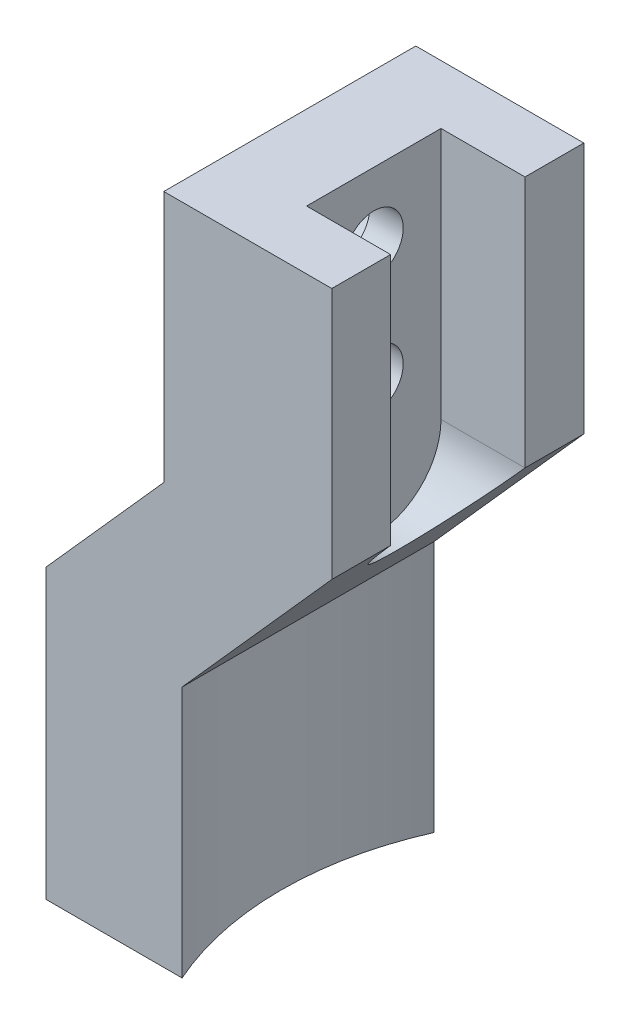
ISO-10303-21;
HEADER;
FILE_DESCRIPTION(('STEP AP214'),'2;1');
FILE_NAME('part.step','',(''),(''),'','','');
FILE_SCHEMA(('AUTOMOTIVE_DESIGN { 1 0 10303 214 1 1 1 1 }'));
ENDSEC;
DATA;
#1=APPLICATION_CONTEXT('core data for automotive mechanical design processes');
#2=APPLICATION_PROTOCOL_DEFINITION('international standard','automotive_design',2000,#1);
#3=PRODUCT_CONTEXT('',#1,'mechanical');
#4=PRODUCT('Part','Part','',(#3));
#5=PRODUCT_RELATED_PRODUCT_CATEGORY('part','',(#4));
#6=PRODUCT_DEFINITION_FORMATION('','',#4);
#7=PRODUCT_DEFINITION_CONTEXT('part definition',#1,'design');
#8=PRODUCT_DEFINITION('design','',#6,#7);
#9=PRODUCT_DEFINITION_SHAPE('','',#8);
#10=(LENGTH_UNIT() NAMED_UNIT(*) SI_UNIT(.MILLI.,.METRE.));
#11=(NAMED_UNIT(*) PLANE_ANGLE_UNIT() SI_UNIT($,.RADIAN.));
#12=(NAMED_UNIT(*) SI_UNIT($,.STERADIAN.) SOLID_ANGLE_UNIT());
#13=UNCERTAINTY_MEASURE_WITH_UNIT(LENGTH_MEASURE(1.E-05),#10,'distance_accuracy_value','');
#14=(GEOMETRIC_REPRESENTATION_CONTEXT(3) GLOBAL_UNCERTAINTY_ASSIGNED_CONTEXT((#13)) GLOBAL_UNIT_ASSIGNED_CONTEXT((#10,
#11,#12)) REPRESENTATION_CONTEXT('',''));
#15=CARTESIAN_POINT('',(0.,0.,0.));
#16=DIRECTION('',(0.,0.,1.));
#17=DIRECTION('',(1.,0.,0.));
#18=AXIS2_PLACEMENT_3D('',#15,#16,#17);
#19=CARTESIAN_POINT('',(-25.,9.00000000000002,7.5));
#20=DIRECTION('',(1.,0.,0.));
#21=DIRECTION('',(0.,1.,0.));
#22=AXIS2_PLACEMENT_3D('',#19,#20,#21);
#23=CYLINDRICAL_SURFACE('',#22,1.75);
#24=CARTESIAN_POINT('',(-13.,9.00000000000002,7.5));
#25=DIRECTION('',(1.,0.,0.));
#26=DIRECTION('',(0.,1.,0.));
#27=AXIS2_PLACEMENT_3D('',#24,#25,#26);
#28=CIRCLE('',#27,1.75);
#29=CARTESIAN_POINT('',(-13.,10.75,7.5));
#30=VERTEX_POINT('',#29);
#31=EDGE_CURVE('E123',#30,#30,#28,.F.);
#32=ORIENTED_EDGE('',*,*,#31,.F.);
#33=EDGE_LOOP('',(#32));
#34=FACE_BOUND('',#33,.T.);
#35=CARTESIAN_POINT('',(-15.,9.00000000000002,7.5));
#36=DIRECTION('',(1.,0.,0.));
#37=DIRECTION('',(0.,1.,0.));
#38=AXIS2_PLACEMENT_3D('',#35,#36,#37);
#39=CIRCLE('',#38,1.75);
#40=CARTESIAN_POINT('',(-15.,10.75,7.5));
#41=VERTEX_POINT('',#40);
#42=EDGE_CURVE('E20',#41,#41,#39,.T.);
#43=ORIENTED_EDGE('',*,*,#42,.F.);
#44=EDGE_LOOP('',(#43));
#45=FACE_BOUND('',#44,.T.);
#46=ADVANCED_FACE('F17',(#34,#45),#23,.F.);
#47=CARTESIAN_POINT('',(-25.,16.,7.5));
#48=DIRECTION('',(1.,0.,0.));
#49=DIRECTION('',(0.,1.,0.));
#50=AXIS2_PLACEMENT_3D('',#47,#48,#49);
#51=CYLINDRICAL_SURFACE('',#50,1.75);
#52=CARTESIAN_POINT('',(-13.,16.,7.5));
#53=DIRECTION('',(1.,0.,0.));
#54=DIRECTION('',(0.,1.,0.));
#55=AXIS2_PLACEMENT_3D('',#52,#53,#54);
#56=CIRCLE('',#55,1.75);
#57=CARTESIAN_POINT('',(-13.,17.75,7.5));
#58=VERTEX_POINT('',#57);
#59=EDGE_CURVE('E114',#58,#58,#56,.F.);
#60=ORIENTED_EDGE('',*,*,#59,.F.);
#61=EDGE_LOOP('',(#60));
#62=FACE_BOUND('',#61,.T.);
#63=CARTESIAN_POINT('',(-15.,16.,7.5));
#64=DIRECTION('',(1.,0.,0.));
#65=DIRECTION('',(0.,1.,0.));
#66=AXIS2_PLACEMENT_3D('',#63,#64,#65);
#67=CIRCLE('',#66,1.75);
#68=CARTESIAN_POINT('',(-15.,17.75,7.5));
#69=VERTEX_POINT('',#68);
#70=EDGE_CURVE('E124',#69,#69,#67,.T.);
#71=ORIENTED_EDGE('',*,*,#70,.F.);
#72=EDGE_LOOP('',(#71));
#73=FACE_BOUND('',#72,.T.);
#74=ADVANCED_FACE('F241',(#62,#73),#51,.F.);
#75=CARTESIAN_POINT('',(-15.,9.00000000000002,7.5));
#76=DIRECTION('',(-1.,0.,0.));
#77=DIRECTION('',(0.,0.,1.));
#78=AXIS2_PLACEMENT_3D('',#75,#76,#77);
#79=PLANE('',#78);
#80=ORIENTED_EDGE('',*,*,#42,.T.);
#81=EDGE_LOOP('',(#80));
#82=FACE_BOUND('',#81,.T.);
#83=CARTESIAN_POINT('',(-15.,9.00000000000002,7.5));
#84=DIRECTION('',(-1.,0.,0.));
#85=DIRECTION('',(0.,0.,1.));
#86=AXIS2_PLACEMENT_3D('',#83,#84,#85);
#87=CIRCLE('',#86,3.);
#88=CARTESIAN_POINT('',(-15.,9.00000000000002,10.5));
#89=VERTEX_POINT('',#88);
#90=EDGE_CURVE('E163',#89,#89,#87,.T.);
#91=ORIENTED_EDGE('',*,*,#90,.T.);
#92=EDGE_LOOP('',(#91));
#93=FACE_BOUND('',#92,.T.);
#94=ADVANCED_FACE('F237',(#82,#93),#79,.T.);
#95=CARTESIAN_POINT('',(-15.,16.,7.5));
#96=DIRECTION('',(-1.,0.,0.));
#97=DIRECTION('',(0.,0.,1.));
#98=AXIS2_PLACEMENT_3D('',#95,#96,#97);
#99=PLANE('',#98);
#100=ORIENTED_EDGE('',*,*,#70,.T.);
#101=EDGE_LOOP('',(#100));
#102=FACE_BOUND('',#101,.T.);
#103=CARTESIAN_POINT('',(-15.,16.,7.5));
#104=DIRECTION('',(-1.,0.,0.));
#105=DIRECTION('',(0.,0.,1.));
#106=AXIS2_PLACEMENT_3D('',#103,#104,#105);
#107=CIRCLE('',#106,3.);
#108=CARTESIAN_POINT('',(-15.,16.,10.5));
#109=VERTEX_POINT('',#108);
#110=EDGE_CURVE('E175',#109,#109,#107,.T.);
#111=ORIENTED_EDGE('',*,*,#110,.T.);
#112=EDGE_LOOP('',(#111));
#113=FACE_BOUND('',#112,.T.);
#114=ADVANCED_FACE('F318',(#102,#113),#99,.T.);
#115=CARTESIAN_POINT('',(-13.,5.00000000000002,7.5));
#116=DIRECTION('',(1.,0.,0.));
#117=DIRECTION('',(0.,1.,0.));
#118=AXIS2_PLACEMENT_3D('',#115,#116,#117);
#119=CYLINDRICAL_SURFACE('',#118,4.);
#120=CARTESIAN_POINT('',(-8.,5.00000000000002,7.5));
#121=DIRECTION('',(-0.746569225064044,0.665307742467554,0.));
#122=DIRECTION('',(0.665307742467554,0.746569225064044,0.));
#123=AXIS2_PLACEMENT_3D('',#120,#121,#122);
#124=ELLIPSE('',#123,5.35784206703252,4.);
#125=CARTESIAN_POINT('',(-8.,5.00000000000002,11.5));
#126=VERTEX_POINT('',#125);
#127=CARTESIAN_POINT('',(-8.,5.00000000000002,3.5));
#128=VERTEX_POINT('',#127);
#129=EDGE_CURVE('E120',#126,#128,#124,.F.);
#130=ORIENTED_EDGE('',*,*,#129,.T.);
#131=DIRECTION('',(1.,0.,0.));
#132=VECTOR('',#131,1.);
#133=CARTESIAN_POINT('',(-13.,5.00000000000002,3.5));
#134=LINE('',#133,#132);
#135=CARTESIAN_POINT('',(-13.,5.00000000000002,3.5));
#136=VERTEX_POINT('',#135);
#137=EDGE_CURVE('E117',#128,#136,#134,.F.);
#138=ORIENTED_EDGE('',*,*,#137,.T.);
#139=CARTESIAN_POINT('',(-13.,5.00000000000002,7.5));
#140=DIRECTION('',(1.,0.,0.));
#141=DIRECTION('',(0.,1.,0.));
#142=AXIS2_PLACEMENT_3D('',#139,#140,#141);
#143=CIRCLE('',#142,4.);
#144=CARTESIAN_POINT('',(-13.,5.00000000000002,11.5));
#145=VERTEX_POINT('',#144);
#146=EDGE_CURVE('E103',#145,#136,#143,.T.);
#147=ORIENTED_EDGE('',*,*,#146,.F.);
#148=DIRECTION('',(1.,0.,0.));
#149=VECTOR('',#148,1.);
#150=CARTESIAN_POINT('',(-13.,5.00000000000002,11.5));
#151=LINE('',#150,#149);
#152=EDGE_CURVE('E131',#145,#126,#151,.T.);
#153=ORIENTED_EDGE('',*,*,#152,.T.);
#154=EDGE_LOOP('',(#130,#138,#147,#153));
#155=FACE_BOUND('',#154,.T.);
#156=ADVANCED_FACE('F118',(#155),#119,.F.);
#157=CARTESIAN_POINT('',(0.,-4.99999999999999,7.5));
#158=DIRECTION('',(0.,-1.,0.));
#159=DIRECTION('',(0.,0.,-1.));
#160=AXIS2_PLACEMENT_3D('',#157,#158,#159);
#161=PLANE('',#160);
#162=DIRECTION('',(0.,0.,1.));
#163=VECTOR('',#162,1.);
#164=CARTESIAN_POINT('',(-16.9115345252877,-4.99999999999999,0.));
#165=LINE('',#164,#163);
#166=CARTESIAN_POINT('',(-16.9115345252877,-4.99999999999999,0.));
#167=VERTEX_POINT('',#166);
#168=CARTESIAN_POINT('',(-16.9115345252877,-4.99999999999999,15.));
#169=VERTEX_POINT('',#168);
#170=EDGE_CURVE('E169',#167,#169,#165,.T.);
#171=ORIENTED_EDGE('',*,*,#170,.T.);
#172=CARTESIAN_POINT('',(0.,-4.99999999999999,7.5));
#173=DIRECTION('',(0.,-1.,0.));
#174=DIRECTION('',(0.,0.,-1.));
#175=AXIS2_PLACEMENT_3D('',#172,#173,#174);
#176=CIRCLE('',#175,18.5);
#177=EDGE_CURVE('E220',#169,#167,#176,.T.);
#178=ORIENTED_EDGE('',*,*,#177,.T.);
#179=EDGE_LOOP('',(#171,#178));
#180=FACE_BOUND('',#179,.T.);
#181=ADVANCED_FACE('F312',(#180),#161,.T.);
#182=CARTESIAN_POINT('',(-13.,20.,3.5));
#183=DIRECTION('',(0.,0.,-1.));
#184=DIRECTION('',(0.,1.,0.));
#185=AXIS2_PLACEMENT_3D('',#182,#183,#184);
#186=PLANE('',#185);
#187=DIRECTION('',(1.,0.,0.));
#188=VECTOR('',#187,1.);
#189=CARTESIAN_POINT('',(-25.,20.,3.5));
#190=LINE('',#189,#188);
#191=CARTESIAN_POINT('',(-8.,20.,3.5));
#192=VERTEX_POINT('',#191);
#193=CARTESIAN_POINT('',(-13.,20.,3.5));
#194=VERTEX_POINT('',#193);
#195=EDGE_CURVE('E129',#192,#194,#190,.F.);
#196=ORIENTED_EDGE('',*,*,#195,.T.);
#197=DIRECTION('',(0.,1.,0.));
#198=VECTOR('',#197,1.);
#199=CARTESIAN_POINT('',(-13.,20.,3.5));
#200=LINE('',#199,#198);
#201=EDGE_CURVE('E111',#136,#194,#200,.T.);
#202=ORIENTED_EDGE('',*,*,#201,.F.);
#203=ORIENTED_EDGE('',*,*,#137,.F.);
#204=DIRECTION('',(0.,-1.,0.));
#205=VECTOR('',#204,1.);
#206=CARTESIAN_POINT('',(-8.,48.8688175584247,3.5));
#207=LINE('',#206,#205);
#208=EDGE_CURVE('E139',#128,#192,#207,.F.);
#209=ORIENTED_EDGE('',*,*,#208,.T.);
#210=EDGE_LOOP('',(#196,#202,#203,#209));
#211=FACE_BOUND('',#210,.T.);
#212=ADVANCED_FACE('F127',(#211),#186,.F.);
#213=CARTESIAN_POINT('',(-13.,20.,7.5));
#214=DIRECTION('',(1.,0.,0.));
#215=DIRECTION('',(0.,1.,0.));
#216=AXIS2_PLACEMENT_3D('',#213,#214,#215);
#217=PLANE('',#216);
#218=ORIENTED_EDGE('',*,*,#146,.T.);
#219=ORIENTED_EDGE('',*,*,#201,.T.);
#220=DIRECTION('',(0.,0.,-1.));
#221=VECTOR('',#220,1.);
#222=CARTESIAN_POINT('',(-13.,20.,15.));
#223=LINE('',#222,#221);
#224=CARTESIAN_POINT('',(-13.,20.,11.5));
#225=VERTEX_POINT('',#224);
#226=EDGE_CURVE('E198',#194,#225,#223,.F.);
#227=ORIENTED_EDGE('',*,*,#226,.T.);
#228=DIRECTION('',(0.,-1.,0.));
#229=VECTOR('',#228,1.);
#230=CARTESIAN_POINT('',(-13.,20.,11.5));
#231=LINE('',#230,#229);
#232=EDGE_CURVE('E113',#225,#145,#231,.T.);
#233=ORIENTED_EDGE('',*,*,#232,.T.);
#234=EDGE_LOOP('',(#218,#219,#227,#233));
#235=FACE_BOUND('',#234,.T.);
#236=ORIENTED_EDGE('',*,*,#59,.T.);
#237=EDGE_LOOP('',(#236));
#238=FACE_BOUND('',#237,.T.);
#239=ORIENTED_EDGE('',*,*,#31,.T.);
#240=EDGE_LOOP('',(#239));
#241=FACE_BOUND('',#240,.T.);
#242=ADVANCED_FACE('F107',(#235,#238,#241),#217,.T.);
#243=CARTESIAN_POINT('',(-13.,20.,11.5));
#244=DIRECTION('',(0.,0.,1.));
#245=DIRECTION('',(0.,-1.,0.));
#246=AXIS2_PLACEMENT_3D('',#243,#244,#245);
#247=PLANE('',#246);
#248=ORIENTED_EDGE('',*,*,#152,.F.);
#249=ORIENTED_EDGE('',*,*,#232,.F.);
#250=DIRECTION('',(1.,0.,0.));
#251=VECTOR('',#250,1.);
#252=CARTESIAN_POINT('',(-25.,20.,11.5));
#253=LINE('',#252,#251);
#254=CARTESIAN_POINT('',(-8.,20.,11.5));
#255=VERTEX_POINT('',#254);
#256=EDGE_CURVE('E192',#225,#255,#253,.T.);
#257=ORIENTED_EDGE('',*,*,#256,.T.);
#258=DIRECTION('',(0.,-1.,0.));
#259=VECTOR('',#258,1.);
#260=CARTESIAN_POINT('',(-8.,48.8688175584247,11.5));
#261=LINE('',#260,#259);
#262=EDGE_CURVE('E160',#255,#126,#261,.T.);
#263=ORIENTED_EDGE('',*,*,#262,.T.);
#264=EDGE_LOOP('',(#248,#249,#257,#263));
#265=FACE_BOUND('',#264,.T.);
#266=ADVANCED_FACE('F303',(#265),#247,.F.);
#267=CARTESIAN_POINT('',(-8.,48.8688175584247,0.));
#268=DIRECTION('',(-1.,0.,0.));
#269=DIRECTION('',(0.,-1.,0.));
#270=AXIS2_PLACEMENT_3D('',#267,#268,#269);
#271=PLANE('',#270);
#272=DIRECTION('',(0.,0.,1.));
#273=VECTOR('',#272,1.);
#274=CARTESIAN_POINT('',(-8.,5.00000000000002,0.));
#275=LINE('',#274,#273);
#276=CARTESIAN_POINT('',(-8.,5.00000000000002,15.));
#277=VERTEX_POINT('',#276);
#278=EDGE_CURVE('E145',#277,#126,#275,.F.);
#279=ORIENTED_EDGE('',*,*,#278,.T.);
#280=ORIENTED_EDGE('',*,*,#262,.F.);
#281=DIRECTION('',(0.,0.,-1.));
#282=VECTOR('',#281,1.);
#283=CARTESIAN_POINT('',(-8.,20.,15.));
#284=LINE('',#283,#282);
#285=CARTESIAN_POINT('',(-8.,20.,15.));
#286=VERTEX_POINT('',#285);
#287=EDGE_CURVE('E187',#255,#286,#284,.F.);
#288=ORIENTED_EDGE('',*,*,#287,.T.);
#289=DIRECTION('',(0.,1.,0.));
#290=VECTOR('',#289,1.);
#291=CARTESIAN_POINT('',(-8.,0.,15.));
#292=LINE('',#291,#290);
#293=EDGE_CURVE('E172',#277,#286,#292,.T.);
#294=ORIENTED_EDGE('',*,*,#293,.F.);
#295=EDGE_LOOP('',(#279,#280,#288,#294));
#296=FACE_BOUND('',#295,.T.);
#297=ADVANCED_FACE('F299',(#296),#271,.F.);
#298=CARTESIAN_POINT('',(-15.,9.00000000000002,7.5));
#299=DIRECTION('',(-1.,0.,0.));
#300=DIRECTION('',(0.,0.,1.));
#301=AXIS2_PLACEMENT_3D('',#298,#299,#300);
#302=CYLINDRICAL_SURFACE('',#301,3.);
#303=ORIENTED_EDGE('',*,*,#90,.F.);
#304=EDGE_LOOP('',(#303));
#305=FACE_BOUND('',#304,.T.);
#306=CARTESIAN_POINT('',(-18.,9.00000000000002,7.5));
#307=DIRECTION('',(-1.,0.,0.));
#308=DIRECTION('',(0.,0.,1.));
#309=AXIS2_PLACEMENT_3D('',#306,#307,#308);
#310=CIRCLE('',#309,3.);
#311=CARTESIAN_POINT('',(-18.,9.00000000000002,10.5));
#312=VERTEX_POINT('',#311);
#313=EDGE_CURVE('E186',#312,#312,#310,.T.);
#314=ORIENTED_EDGE('',*,*,#313,.T.);
#315=EDGE_LOOP('',(#314));
#316=FACE_BOUND('',#315,.T.);
#317=ADVANCED_FACE('F295',(#305,#316),#302,.F.);
#318=CARTESIAN_POINT('',(-15.,16.,7.5));
#319=DIRECTION('',(-1.,0.,0.));
#320=DIRECTION('',(0.,0.,1.));
#321=AXIS2_PLACEMENT_3D('',#318,#319,#320);
#322=CYLINDRICAL_SURFACE('',#321,3.);
#323=ORIENTED_EDGE('',*,*,#110,.F.);
#324=EDGE_LOOP('',(#323));
#325=FACE_BOUND('',#324,.T.);
#326=CARTESIAN_POINT('',(-18.,16.,7.5));
#327=DIRECTION('',(-1.,0.,0.));
#328=DIRECTION('',(0.,0.,1.));
#329=AXIS2_PLACEMENT_3D('',#326,#327,#328);
#330=CIRCLE('',#329,3.);
#331=CARTESIAN_POINT('',(-18.,16.,10.5));
#332=VERTEX_POINT('',#331);
#333=EDGE_CURVE('E209',#332,#332,#330,.T.);
#334=ORIENTED_EDGE('',*,*,#333,.T.);
#335=EDGE_LOOP('',(#334));
#336=FACE_BOUND('',#335,.T.);
#337=ADVANCED_FACE('F291',(#325,#336),#322,.F.);
#338=CARTESIAN_POINT('',(0.,0.,15.));
#339=DIRECTION('',(0.,0.,1.));
#340=DIRECTION('',(1.,0.,0.));
#341=AXIS2_PLACEMENT_3D('',#338,#339,#340);
#342=PLANE('',#341);
#343=ORIENTED_EDGE('',*,*,#293,.T.);
#344=DIRECTION('',(1.,0.,0.));
#345=VECTOR('',#344,1.);
#346=CARTESIAN_POINT('',(-25.,20.,15.));
#347=LINE('',#346,#345);
#348=CARTESIAN_POINT('',(-18.,20.,15.));
#349=VERTEX_POINT('',#348);
#350=EDGE_CURVE('E184',#286,#349,#347,.F.);
#351=ORIENTED_EDGE('',*,*,#350,.T.);
#352=DIRECTION('',(0.,1.,0.));
#353=VECTOR('',#352,1.);
#354=CARTESIAN_POINT('',(-18.,20.,15.));
#355=LINE('',#354,#353);
#356=CARTESIAN_POINT('',(-18.,5.00000000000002,15.));
#357=VERTEX_POINT('',#356);
#358=EDGE_CURVE('E213',#349,#357,#355,.F.);
#359=ORIENTED_EDGE('',*,*,#358,.T.);
#360=DIRECTION('',(0.665307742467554,0.746569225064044,0.));
#361=VECTOR('',#360,1.);
#362=CARTESIAN_POINT('',(-18.,5.00000000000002,15.));
#363=LINE('',#362,#361);
#364=CARTESIAN_POINT('',(-25.,-2.85498836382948,15.));
#365=VERTEX_POINT('',#364);
#366=EDGE_CURVE('E478',#357,#365,#363,.F.);
#367=ORIENTED_EDGE('',*,*,#366,.T.);
#368=DIRECTION('',(0.,1.,0.));
#369=VECTOR('',#368,1.);
#370=CARTESIAN_POINT('',(-25.,20.,15.));
#371=LINE('',#370,#369);
#372=CARTESIAN_POINT('',(-25.,-20.,15.));
#373=VERTEX_POINT('',#372);
#374=EDGE_CURVE('E174',#365,#373,#371,.F.);
#375=ORIENTED_EDGE('',*,*,#374,.T.);
#376=DIRECTION('',(1.,0.,0.));
#377=VECTOR('',#376,1.);
#378=CARTESIAN_POINT('',(-25.,-20.,15.));
#379=LINE('',#378,#377);
#380=CARTESIAN_POINT('',(-16.9115345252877,-20.,15.));
#381=VERTEX_POINT('',#380);
#382=EDGE_CURVE('E223',#373,#381,#379,.T.);
#383=ORIENTED_EDGE('',*,*,#382,.T.);
#384=DIRECTION('',(0.,-1.,0.));
#385=VECTOR('',#384,1.);
#386=CARTESIAN_POINT('',(-16.9115345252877,-4.99999999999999,15.));
#387=LINE('',#386,#385);
#388=EDGE_CURVE('E180',#381,#169,#387,.F.);
#389=ORIENTED_EDGE('',*,*,#388,.T.);
#390=DIRECTION('',(-0.665307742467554,-0.746569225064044,0.));
#391=VECTOR('',#390,1.);
#392=CARTESIAN_POINT('',(-16.9115345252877,-4.99999999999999,15.));
#393=LINE('',#392,#391);
#394=EDGE_CURVE('E166',#169,#277,#393,.F.);
#395=ORIENTED_EDGE('',*,*,#394,.T.);
#396=EDGE_LOOP('',(#343,#351,#359,#367,#375,#383,#389,#395));
#397=FACE_BOUND('',#396,.T.);
#398=ADVANCED_FACE('F287',(#397),#342,.T.);
#399=CARTESIAN_POINT('',(-25.,20.,15.));
#400=DIRECTION('',(1.,0.,0.));
#401=DIRECTION('',(0.,0.,-1.));
#402=AXIS2_PLACEMENT_3D('',#399,#400,#401);
#403=PLANE('',#402);
#404=DIRECTION('',(0.,0.,1.));
#405=VECTOR('',#404,1.);
#406=CARTESIAN_POINT('',(-25.,-2.85498836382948,0.));
#407=LINE('',#406,#405);
#408=CARTESIAN_POINT('',(-25.,-2.85498836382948,0.));
#409=VERTEX_POINT('',#408);
#410=EDGE_CURVE('E212',#365,#409,#407,.F.);
#411=ORIENTED_EDGE('',*,*,#410,.T.);
#412=DIRECTION('',(0.,1.,0.));
#413=VECTOR('',#412,1.);
#414=CARTESIAN_POINT('',(-25.,0.,0.));
#415=LINE('',#414,#413);
#416=CARTESIAN_POINT('',(-25.,-20.,0.));
#417=VERTEX_POINT('',#416);
#418=EDGE_CURVE('E494',#409,#417,#415,.F.);
#419=ORIENTED_EDGE('',*,*,#418,.T.);
#420=DIRECTION('',(0.,0.,1.));
#421=VECTOR('',#420,1.);
#422=CARTESIAN_POINT('',(-25.,-20.,15.));
#423=LINE('',#422,#421);
#424=EDGE_CURVE('E486',#417,#373,#423,.T.);
#425=ORIENTED_EDGE('',*,*,#424,.T.);
#426=ORIENTED_EDGE('',*,*,#374,.F.);
#427=EDGE_LOOP('',(#411,#419,#425,#426));
#428=FACE_BOUND('',#427,.T.);
#429=ADVANCED_FACE('F283',(#428),#403,.F.);
#430=CARTESIAN_POINT('',(-25.,-20.,15.));
#431=DIRECTION('',(0.,1.,0.));
#432=DIRECTION('',(0.,0.,1.));
#433=AXIS2_PLACEMENT_3D('',#430,#431,#432);
#434=PLANE('',#433);
#435=CARTESIAN_POINT('',(0.,-20.,7.5));
#436=DIRECTION('',(0.,-1.,0.));
#437=DIRECTION('',(0.,0.,-1.));
#438=AXIS2_PLACEMENT_3D('',#435,#436,#437);
#439=CIRCLE('',#438,18.5);
#440=CARTESIAN_POINT('',(-16.9115345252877,-20.,0.));
#441=VERTEX_POINT('',#440);
#442=EDGE_CURVE('E183',#441,#381,#439,.F.);
#443=ORIENTED_EDGE('',*,*,#442,.T.);
#444=ORIENTED_EDGE('',*,*,#382,.F.);
#445=ORIENTED_EDGE('',*,*,#424,.F.);
#446=DIRECTION('',(1.,0.,0.));
#447=VECTOR('',#446,1.);
#448=CARTESIAN_POINT('',(0.,-20.,0.));
#449=LINE('',#448,#447);
#450=EDGE_CURVE('E491',#417,#441,#449,.T.);
#451=ORIENTED_EDGE('',*,*,#450,.T.);
#452=EDGE_LOOP('',(#443,#444,#445,#451));
#453=FACE_BOUND('',#452,.T.);
#454=ADVANCED_FACE('F279',(#453),#434,.F.);
#455=CARTESIAN_POINT('',(0.,-4.99999999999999,7.5));
#456=DIRECTION('',(0.,-1.,0.));
#457=DIRECTION('',(0.,0.,-1.));
#458=AXIS2_PLACEMENT_3D('',#455,#456,#457);
#459=CYLINDRICAL_SURFACE('',#458,18.5);
#460=ORIENTED_EDGE('',*,*,#442,.F.);
#461=DIRECTION('',(0.,1.,0.));
#462=VECTOR('',#461,1.);
#463=CARTESIAN_POINT('',(-16.9115345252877,0.,0.));
#464=LINE('',#463,#462);
#465=EDGE_CURVE('E157',#441,#167,#464,.T.);
#466=ORIENTED_EDGE('',*,*,#465,.T.);
#467=ORIENTED_EDGE('',*,*,#177,.F.);
#468=ORIENTED_EDGE('',*,*,#388,.F.);
#469=EDGE_LOOP('',(#460,#466,#467,#468));
#470=FACE_BOUND('',#469,.T.);
#471=ADVANCED_FACE('F275',(#470),#459,.F.);
#472=CARTESIAN_POINT('',(-16.9115345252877,-4.99999999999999,0.));
#473=DIRECTION('',(-0.746569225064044,0.665307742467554,0.));
#474=DIRECTION('',(-0.665307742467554,-0.746569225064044,0.));
#475=AXIS2_PLACEMENT_3D('',#472,#473,#474);
#476=PLANE('',#475);
#477=ORIENTED_EDGE('',*,*,#394,.F.);
#478=ORIENTED_EDGE('',*,*,#170,.F.);
#479=DIRECTION('',(0.665307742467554,0.746569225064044,0.));
#480=VECTOR('',#479,1.);
#481=CARTESIAN_POINT('',(-16.9115345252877,-4.99999999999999,0.));
#482=LINE('',#481,#480);
#483=CARTESIAN_POINT('',(-8.,5.00000000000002,0.));
#484=VERTEX_POINT('',#483);
#485=EDGE_CURVE('E152',#167,#484,#482,.T.);
#486=ORIENTED_EDGE('',*,*,#485,.T.);
#487=DIRECTION('',(0.,0.,1.));
#488=VECTOR('',#487,1.);
#489=CARTESIAN_POINT('',(-8.,5.00000000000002,0.));
#490=LINE('',#489,#488);
#491=EDGE_CURVE('E141',#484,#128,#490,.T.);
#492=ORIENTED_EDGE('',*,*,#491,.T.);
#493=ORIENTED_EDGE('',*,*,#129,.F.);
#494=ORIENTED_EDGE('',*,*,#278,.F.);
#495=EDGE_LOOP('',(#477,#478,#486,#492,#493,#494));
#496=FACE_BOUND('',#495,.T.);
#497=ADVANCED_FACE('F271',(#496),#476,.F.);
#498=CARTESIAN_POINT('',(-8.,48.8688175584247,0.));
#499=DIRECTION('',(-1.,0.,0.));
#500=DIRECTION('',(0.,-1.,0.));
#501=AXIS2_PLACEMENT_3D('',#498,#499,#500);
#502=PLANE('',#501);
#503=ORIENTED_EDGE('',*,*,#491,.F.);
#504=DIRECTION('',(0.,1.,0.));
#505=VECTOR('',#504,1.);
#506=CARTESIAN_POINT('',(-8.,0.,0.));
#507=LINE('',#506,#505);
#508=CARTESIAN_POINT('',(-8.,20.,0.));
#509=VERTEX_POINT('',#508);
#510=EDGE_CURVE('E148',#484,#509,#507,.T.);
#511=ORIENTED_EDGE('',*,*,#510,.T.);
#512=DIRECTION('',(0.,0.,-1.));
#513=VECTOR('',#512,1.);
#514=CARTESIAN_POINT('',(-8.,20.,15.));
#515=LINE('',#514,#513);
#516=EDGE_CURVE('E140',#509,#192,#515,.F.);
#517=ORIENTED_EDGE('',*,*,#516,.T.);
#518=ORIENTED_EDGE('',*,*,#208,.F.);
#519=EDGE_LOOP('',(#503,#511,#517,#518));
#520=FACE_BOUND('',#519,.T.);
#521=ADVANCED_FACE('F267',(#520),#502,.F.);
#522=CARTESIAN_POINT('',(-25.,20.,15.));
#523=DIRECTION('',(0.,-1.,0.));
#524=DIRECTION('',(0.,0.,-1.));
#525=AXIS2_PLACEMENT_3D('',#522,#523,#524);
#526=PLANE('',#525);
#527=DIRECTION('',(0.,0.,1.));
#528=VECTOR('',#527,1.);
#529=CARTESIAN_POINT('',(-18.,20.,0.));
#530=LINE('',#529,#528);
#531=CARTESIAN_POINT('',(-18.,20.,0.));
#532=VERTEX_POINT('',#531);
#533=EDGE_CURVE('E216',#532,#349,#530,.T.);
#534=ORIENTED_EDGE('',*,*,#533,.T.);
#535=ORIENTED_EDGE('',*,*,#350,.F.);
#536=ORIENTED_EDGE('',*,*,#287,.F.);
#537=ORIENTED_EDGE('',*,*,#256,.F.);
#538=ORIENTED_EDGE('',*,*,#226,.F.);
#539=ORIENTED_EDGE('',*,*,#195,.F.);
#540=ORIENTED_EDGE('',*,*,#516,.F.);
#541=DIRECTION('',(1.,0.,0.));
#542=VECTOR('',#541,1.);
#543=CARTESIAN_POINT('',(0.,20.,0.));
#544=LINE('',#543,#542);
#545=EDGE_CURVE('E151',#509,#532,#544,.F.);
#546=ORIENTED_EDGE('',*,*,#545,.T.);
#547=EDGE_LOOP('',(#534,#535,#536,#537,#538,#539,#540,#546));
#548=FACE_BOUND('',#547,.T.);
#549=ADVANCED_FACE('F263',(#548),#526,.F.);
#550=CARTESIAN_POINT('',(-18.,20.,0.));
#551=DIRECTION('',(1.,0.,0.));
#552=DIRECTION('',(0.,1.,0.));
#553=AXIS2_PLACEMENT_3D('',#550,#551,#552);
#554=PLANE('',#553);
#555=ORIENTED_EDGE('',*,*,#333,.F.);
#556=EDGE_LOOP('',(#555));
#557=FACE_BOUND('',#556,.T.);
#558=ORIENTED_EDGE('',*,*,#533,.F.);
#559=DIRECTION('',(0.,1.,0.));
#560=VECTOR('',#559,1.);
#561=CARTESIAN_POINT('',(-18.,0.,0.));
#562=LINE('',#561,#560);
#563=CARTESIAN_POINT('',(-18.,5.00000000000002,0.));
#564=VERTEX_POINT('',#563);
#565=EDGE_CURVE('E26',#532,#564,#562,.F.);
#566=ORIENTED_EDGE('',*,*,#565,.T.);
#567=DIRECTION('',(0.,0.,1.));
#568=VECTOR('',#567,1.);
#569=CARTESIAN_POINT('',(-18.,5.00000000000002,0.));
#570=LINE('',#569,#568);
#571=EDGE_CURVE('E34',#564,#357,#570,.T.);
#572=ORIENTED_EDGE('',*,*,#571,.T.);
#573=ORIENTED_EDGE('',*,*,#358,.F.);
#574=EDGE_LOOP('',(#558,#566,#572,#573));
#575=FACE_BOUND('',#574,.T.);
#576=ORIENTED_EDGE('',*,*,#313,.F.);
#577=EDGE_LOOP('',(#576));
#578=FACE_BOUND('',#577,.T.);
#579=ADVANCED_FACE('F257',(#557,#575,#578),#554,.F.);
#580=CARTESIAN_POINT('',(-18.,5.00000000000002,0.));
#581=DIRECTION('',(0.746569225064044,-0.665307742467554,0.));
#582=DIRECTION('',(0.665307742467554,0.746569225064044,0.));
#583=AXIS2_PLACEMENT_3D('',#580,#581,#582);
#584=PLANE('',#583);
#585=ORIENTED_EDGE('',*,*,#571,.F.);
#586=DIRECTION('',(-0.665307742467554,-0.746569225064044,0.));
#587=VECTOR('',#586,1.);
#588=CARTESIAN_POINT('',(-18.,5.00000000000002,0.));
#589=LINE('',#588,#587);
#590=EDGE_CURVE('E11',#564,#409,#589,.T.);
#591=ORIENTED_EDGE('',*,*,#590,.T.);
#592=ORIENTED_EDGE('',*,*,#410,.F.);
#593=ORIENTED_EDGE('',*,*,#366,.F.);
#594=EDGE_LOOP('',(#585,#591,#592,#593));
#595=FACE_BOUND('',#594,.T.);
#596=ADVANCED_FACE('F251',(#595),#584,.F.);
#597=CARTESIAN_POINT('',(0.,0.,0.));
#598=DIRECTION('',(0.,0.,1.));
#599=DIRECTION('',(1.,0.,0.));
#600=AXIS2_PLACEMENT_3D('',#597,#598,#599);
#601=PLANE('',#600);
#602=ORIENTED_EDGE('',*,*,#565,.F.);
#603=ORIENTED_EDGE('',*,*,#545,.F.);
#604=ORIENTED_EDGE('',*,*,#510,.F.);
#605=ORIENTED_EDGE('',*,*,#485,.F.);
#606=ORIENTED_EDGE('',*,*,#465,.F.);
#607=ORIENTED_EDGE('',*,*,#450,.F.);
#608=ORIENTED_EDGE('',*,*,#418,.F.);
#609=ORIENTED_EDGE('',*,*,#590,.F.);
#610=EDGE_LOOP('',(#602,#603,#604,#605,#606,#607,#608,#609));
#611=FACE_BOUND('',#610,.T.);
#612=ADVANCED_FACE('F249',(#611),#601,.F.);
#613=CLOSED_SHELL('',(#46,#74,#94,#114,#156,#181,#212,#242,#266,#297,#317,#337,#398,#429,#454,
#471,#497,#521,#549,#579,#596,#612));
#614=MANIFOLD_SOLID_BREP('B1',#613);
#615=ADVANCED_BREP_SHAPE_REPRESENTATION('',(#18,#614),#14);
#616=SHAPE_DEFINITION_REPRESENTATION(#9,#615);
ENDSEC;
END-ISO-10303-21;
